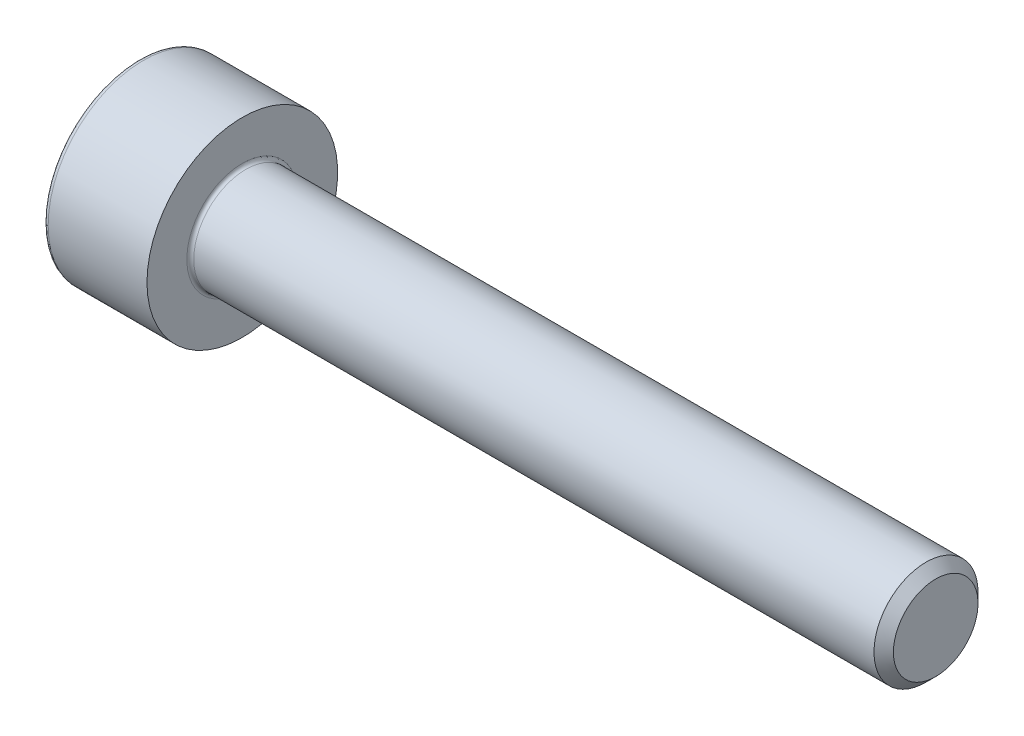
from build123d import *

# Parameters (mm, degrees)
FILLET1_R   = 0.1
FILLET2_R   = 0.15
HEX_2_DEPTH = 1.3


with BuildPart() as part:
    # BodySke → Base-Revolve (revolve)
    with BuildSketch(Plane.XY, mode=Mode.PRIVATE) as base_revolve_sk:
        Polygon((0, 0), (0, 2.75), (3, 2.75), (3, 1.5), (22.7195, 1.5), (23, 1.2195), (23, 0), align=None)
    revolve(base_revolve_sk.sketch.rotate(Axis((-31.75, 0, 0), (1, 0, 0)), 90), axis=Axis((-31.75, 0, 0), (1, 0, 0)))

    # Fillet1
    fillet1_edges = [part.edges().sort_by_distance(p)[0] for p in [
        (3, 0, -1.5),
    ]]
    fillet(fillet1_edges, radius=FILLET1_R)

    # Fillet2
    fillet2_edges = [part.edges().sort_by_distance(p)[0] for p in [
        (0, 0, -2.75),
    ]]
    fillet(fillet2_edges, radius=FILLET2_R)

    # Sketch2 → Hex-PreBroach (revolve, cut)
    with BuildSketch(Plane.XY, mode=Mode.PRIVATE) as hex_prebroach_sk:
        Polygon((0, 1.28), (1.3, 1.28), (2.039008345, 0), (0, 0), align=None)
    revolve(hex_prebroach_sk.sketch.rotate(Axis((0, 0, 0), (1, 0, 0)), 90), axis=Axis((0, 0, 0), (1, 0, 0)), mode=Mode.SUBTRACT)

    # Sketch3 → Hex 2 (cut)
    with BuildSketch(Plane(origin=(0, 0, 0), x_dir=(0, 0.500000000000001, 0.866025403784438), z_dir=(-1, 0, 0))):
        Polygon((0.739008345, 1.28), (-0.739008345, 1.28), (-1.478016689, 0), (-0.739008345, -1.28), (0.739008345, -1.28), (1.478016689, 0), align=None)
    extrude(amount=-HEX_2_DEPTH, mode=Mode.SUBTRACT)


solid = part.part
